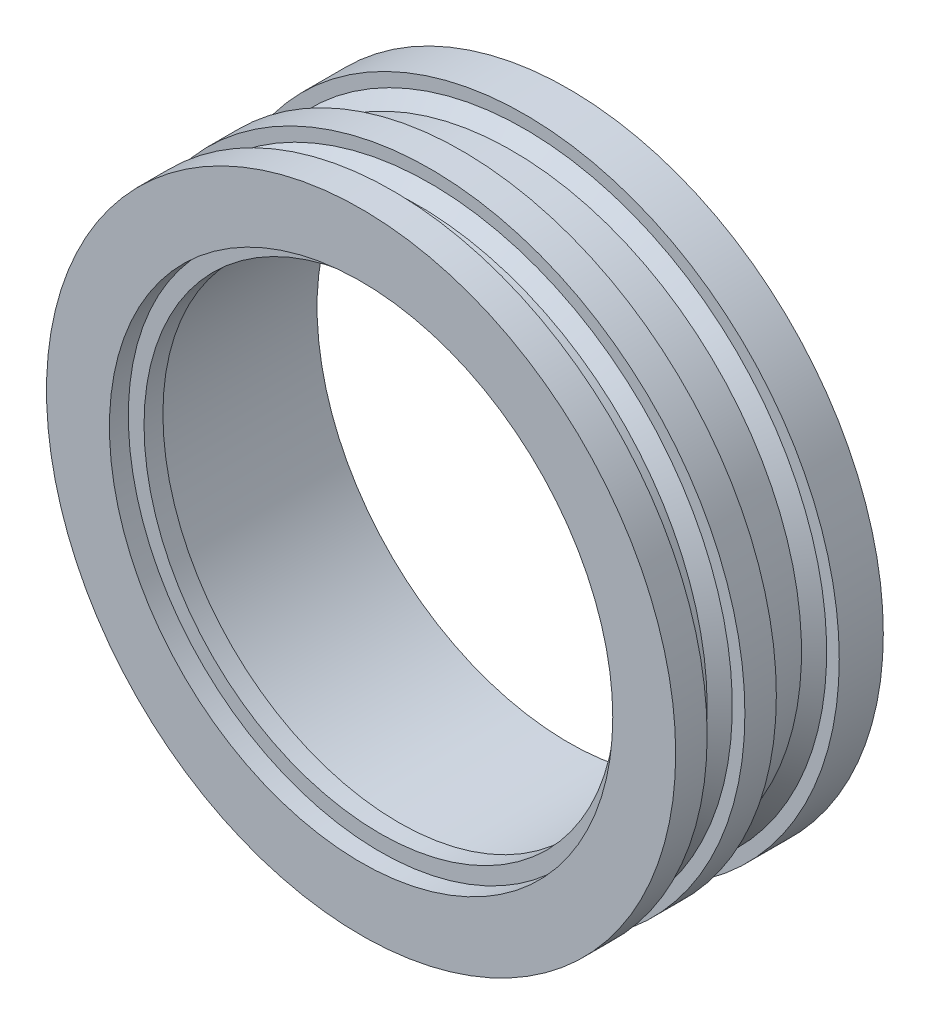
ISO-10303-21;
HEADER;
FILE_DESCRIPTION(('STEP AP214'),'2;1');
FILE_NAME('part.step','',(''),(''),'','','');
FILE_SCHEMA(('AUTOMOTIVE_DESIGN { 1 0 10303 214 1 1 1 1 }'));
ENDSEC;
DATA;
#1=APPLICATION_CONTEXT('core data for automotive mechanical design processes');
#2=APPLICATION_PROTOCOL_DEFINITION('international standard','automotive_design',2000,#1);
#3=PRODUCT_CONTEXT('',#1,'mechanical');
#4=PRODUCT('Part','Part','',(#3));
#5=PRODUCT_RELATED_PRODUCT_CATEGORY('part','',(#4));
#6=PRODUCT_DEFINITION_FORMATION('','',#4);
#7=PRODUCT_DEFINITION_CONTEXT('part definition',#1,'design');
#8=PRODUCT_DEFINITION('design','',#6,#7);
#9=PRODUCT_DEFINITION_SHAPE('','',#8);
#10=(LENGTH_UNIT() NAMED_UNIT(*) SI_UNIT(.MILLI.,.METRE.));
#11=(NAMED_UNIT(*) PLANE_ANGLE_UNIT() SI_UNIT($,.RADIAN.));
#12=(NAMED_UNIT(*) SI_UNIT($,.STERADIAN.) SOLID_ANGLE_UNIT());
#13=UNCERTAINTY_MEASURE_WITH_UNIT(LENGTH_MEASURE(1.E-05),#10,'distance_accuracy_value','');
#14=(GEOMETRIC_REPRESENTATION_CONTEXT(3) GLOBAL_UNCERTAINTY_ASSIGNED_CONTEXT((#13)) GLOBAL_UNIT_ASSIGNED_CONTEXT((#10,
#11,#12)) REPRESENTATION_CONTEXT('',''));
#15=CARTESIAN_POINT('',(0.,0.,0.));
#16=DIRECTION('',(0.,0.,1.));
#17=DIRECTION('',(1.,0.,0.));
#18=AXIS2_PLACEMENT_3D('',#15,#16,#17);
#19=CARTESIAN_POINT('',(0.,0.,558.8));
#20=DIRECTION('',(0.,0.,-1.));
#21=DIRECTION('',(-1.,0.,0.));
#22=AXIS2_PLACEMENT_3D('',#19,#20,#21);
#23=CONICAL_SURFACE('',#22,1219.2,0.785398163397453);
#24=CARTESIAN_POINT('',(0.,0.,558.8));
#25=DIRECTION('',(0.,0.,-1.));
#26=DIRECTION('',(-1.,0.,0.));
#27=AXIS2_PLACEMENT_3D('',#24,#25,#26);
#28=CIRCLE('',#27,1219.2);
#29=CARTESIAN_POINT('',(-1219.2,0.,558.8));
#30=VERTEX_POINT('',#29);
#31=EDGE_CURVE('E18',#30,#30,#28,.F.);
#32=ORIENTED_EDGE('',*,*,#31,.T.);
#33=EDGE_LOOP('',(#32));
#34=FACE_BOUND('',#33,.T.);
#35=CARTESIAN_POINT('',(0.,0.,609.6));
#36=DIRECTION('',(0.,0.,1.));
#37=DIRECTION('',(1.,0.,0.));
#38=AXIS2_PLACEMENT_3D('',#35,#36,#37);
#39=CIRCLE('',#38,1168.4);
#40=CARTESIAN_POINT('',(1168.4,0.,609.6));
#41=VERTEX_POINT('',#40);
#42=EDGE_CURVE('E30',#41,#41,#39,.F.);
#43=ORIENTED_EDGE('',*,*,#42,.T.);
#44=EDGE_LOOP('',(#43));
#45=FACE_BOUND('',#44,.T.);
#46=ADVANCED_FACE('F15',(#34,#45),#23,.T.);
#47=CARTESIAN_POINT('',(1168.4,0.,558.8));
#48=DIRECTION('',(0.,0.,-1.));
#49=DIRECTION('',(-1.,0.,0.));
#50=AXIS2_PLACEMENT_3D('',#47,#48,#49);
#51=PLANE('',#50);
#52=ORIENTED_EDGE('',*,*,#31,.F.);
#53=EDGE_LOOP('',(#52));
#54=FACE_BOUND('',#53,.T.);
#55=CARTESIAN_POINT('',(0.,0.,558.8));
#56=DIRECTION('',(0.,0.,1.));
#57=DIRECTION('',(1.,0.,0.));
#58=AXIS2_PLACEMENT_3D('',#55,#56,#57);
#59=CIRCLE('',#58,1270.);
#60=CARTESIAN_POINT('',(1270.,0.,558.8));
#61=VERTEX_POINT('',#60);
#62=EDGE_CURVE('E70',#61,#61,#59,.F.);
#63=ORIENTED_EDGE('',*,*,#62,.F.);
#64=EDGE_LOOP('',(#63));
#65=FACE_BOUND('',#64,.T.);
#66=ADVANCED_FACE('F82',(#54,#65),#51,.F.);
#67=CARTESIAN_POINT('',(0.,0.,660.4));
#68=DIRECTION('',(0.,0.,-1.));
#69=DIRECTION('',(-1.,0.,0.));
#70=AXIS2_PLACEMENT_3D('',#67,#68,#69);
#71=CYLINDRICAL_SURFACE('',#70,1168.4);
#72=CARTESIAN_POINT('',(0.,0.,660.4));
#73=DIRECTION('',(0.,0.,1.));
#74=DIRECTION('',(-1.,0.,0.));
#75=AXIS2_PLACEMENT_3D('',#72,#73,#74);
#76=CIRCLE('',#75,1168.4);
#77=CARTESIAN_POINT('',(-1168.4,0.,660.4));
#78=VERTEX_POINT('',#77);
#79=EDGE_CURVE('E69',#78,#78,#76,.T.);
#80=ORIENTED_EDGE('',*,*,#79,.F.);
#81=EDGE_LOOP('',(#80));
#82=FACE_BOUND('',#81,.T.);
#83=ORIENTED_EDGE('',*,*,#42,.F.);
#84=EDGE_LOOP('',(#83));
#85=FACE_BOUND('',#84,.T.);
#86=ADVANCED_FACE('F85',(#82,#85),#71,.T.);
#87=CARTESIAN_POINT('',(0.,0.,0.));
#88=DIRECTION('',(0.,0.,1.));
#89=DIRECTION('',(1.,0.,0.));
#90=AXIS2_PLACEMENT_3D('',#87,#88,#89);
#91=CYLINDRICAL_SURFACE('',#90,1270.);
#92=CARTESIAN_POINT('',(0.,0.,431.8));
#93=DIRECTION('',(0.,0.,1.));
#94=DIRECTION('',(1.,0.,0.));
#95=AXIS2_PLACEMENT_3D('',#92,#93,#94);
#96=CIRCLE('',#95,1270.);
#97=CARTESIAN_POINT('',(1270.,0.,431.8));
#98=VERTEX_POINT('',#97);
#99=EDGE_CURVE('E67',#98,#98,#96,.T.);
#100=ORIENTED_EDGE('',*,*,#99,.T.);
#101=EDGE_LOOP('',(#100));
#102=FACE_BOUND('',#101,.T.);
#103=ORIENTED_EDGE('',*,*,#62,.T.);
#104=EDGE_LOOP('',(#103));
#105=FACE_BOUND('',#104,.T.);
#106=ADVANCED_FACE('F91',(#102,#105),#91,.T.);
#107=CARTESIAN_POINT('',(0.,0.,711.2));
#108=DIRECTION('',(0.,0.,1.));
#109=DIRECTION('',(1.,0.,0.));
#110=AXIS2_PLACEMENT_3D('',#107,#108,#109);
#111=CONICAL_SURFACE('',#110,1219.2,0.785398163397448);
#112=ORIENTED_EDGE('',*,*,#79,.T.);
#113=EDGE_LOOP('',(#112));
#114=FACE_BOUND('',#113,.T.);
#115=CARTESIAN_POINT('',(0.,0.,711.2));
#116=DIRECTION('',(0.,0.,1.));
#117=DIRECTION('',(1.,0.,0.));
#118=AXIS2_PLACEMENT_3D('',#115,#116,#117);
#119=CIRCLE('',#118,1219.2);
#120=CARTESIAN_POINT('',(1219.2,0.,711.2));
#121=VERTEX_POINT('',#120);
#122=EDGE_CURVE('E64',#121,#121,#119,.F.);
#123=ORIENTED_EDGE('',*,*,#122,.T.);
#124=EDGE_LOOP('',(#123));
#125=FACE_BOUND('',#124,.T.);
#126=ADVANCED_FACE('F156',(#114,#125),#111,.T.);
#127=CARTESIAN_POINT('',(1270.,0.,431.8));
#128=DIRECTION('',(0.,0.,1.));
#129=DIRECTION('',(1.,0.,0.));
#130=AXIS2_PLACEMENT_3D('',#127,#128,#129);
#131=PLANE('',#130);
#132=CARTESIAN_POINT('',(0.,0.,431.8));
#133=DIRECTION('',(0.,0.,1.));
#134=DIRECTION('',(0.,-1.,0.));
#135=AXIS2_PLACEMENT_3D('',#132,#133,#134);
#136=CIRCLE('',#135,1219.2);
#137=CARTESIAN_POINT('',(0.,-1219.2,431.8));
#138=VERTEX_POINT('',#137);
#139=EDGE_CURVE('E61',#138,#138,#136,.F.);
#140=ORIENTED_EDGE('',*,*,#139,.F.);
#141=EDGE_LOOP('',(#140));
#142=FACE_BOUND('',#141,.T.);
#143=ORIENTED_EDGE('',*,*,#99,.F.);
#144=EDGE_LOOP('',(#143));
#145=FACE_BOUND('',#144,.T.);
#146=ADVANCED_FACE('F152',(#142,#145),#131,.F.);
#147=CARTESIAN_POINT('',(1270.,0.,711.2));
#148=DIRECTION('',(0.,0.,1.));
#149=DIRECTION('',(1.,0.,0.));
#150=AXIS2_PLACEMENT_3D('',#147,#148,#149);
#151=PLANE('',#150);
#152=ORIENTED_EDGE('',*,*,#122,.F.);
#153=EDGE_LOOP('',(#152));
#154=FACE_BOUND('',#153,.T.);
#155=CARTESIAN_POINT('',(0.,0.,711.2));
#156=DIRECTION('',(0.,0.,1.));
#157=DIRECTION('',(1.,0.,0.));
#158=AXIS2_PLACEMENT_3D('',#155,#156,#157);
#159=CIRCLE('',#158,1270.);
#160=CARTESIAN_POINT('',(1270.,0.,711.2));
#161=VERTEX_POINT('',#160);
#162=EDGE_CURVE('E58',#161,#161,#159,.T.);
#163=ORIENTED_EDGE('',*,*,#162,.F.);
#164=EDGE_LOOP('',(#163));
#165=FACE_BOUND('',#164,.T.);
#166=ADVANCED_FACE('F148',(#154,#165),#151,.F.);
#167=CARTESIAN_POINT('',(0.,0.,431.8));
#168=DIRECTION('',(0.,0.,1.));
#169=DIRECTION('',(0.,-1.,0.));
#170=AXIS2_PLACEMENT_3D('',#167,#168,#169);
#171=CONICAL_SURFACE('',#170,1219.2,0.785398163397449);
#172=ORIENTED_EDGE('',*,*,#139,.T.);
#173=EDGE_LOOP('',(#172));
#174=FACE_BOUND('',#173,.T.);
#175=CARTESIAN_POINT('',(0.,0.,381.));
#176=DIRECTION('',(0.,0.,1.));
#177=DIRECTION('',(1.,0.,0.));
#178=AXIS2_PLACEMENT_3D('',#175,#176,#177);
#179=CIRCLE('',#178,1168.4);
#180=CARTESIAN_POINT('',(1168.4,0.,381.));
#181=VERTEX_POINT('',#180);
#182=EDGE_CURVE('E57',#181,#181,#179,.T.);
#183=ORIENTED_EDGE('',*,*,#182,.T.);
#184=EDGE_LOOP('',(#183));
#185=FACE_BOUND('',#184,.T.);
#186=ADVANCED_FACE('F144',(#174,#185),#171,.T.);
#187=CARTESIAN_POINT('',(0.,0.,0.));
#188=DIRECTION('',(0.,0.,1.));
#189=DIRECTION('',(1.,0.,0.));
#190=AXIS2_PLACEMENT_3D('',#187,#188,#189);
#191=CYLINDRICAL_SURFACE('',#190,1270.);
#192=CARTESIAN_POINT('',(0.,0.,838.2));
#193=DIRECTION('',(0.,0.,1.));
#194=DIRECTION('',(1.,0.,0.));
#195=AXIS2_PLACEMENT_3D('',#192,#193,#194);
#196=CIRCLE('',#195,1270.);
#197=CARTESIAN_POINT('',(1270.,0.,838.2));
#198=VERTEX_POINT('',#197);
#199=EDGE_CURVE('E54',#198,#198,#196,.T.);
#200=ORIENTED_EDGE('',*,*,#199,.F.);
#201=EDGE_LOOP('',(#200));
#202=FACE_BOUND('',#201,.T.);
#203=ORIENTED_EDGE('',*,*,#162,.T.);
#204=EDGE_LOOP('',(#203));
#205=FACE_BOUND('',#204,.T.);
#206=ADVANCED_FACE('F140',(#202,#205),#191,.T.);
#207=CARTESIAN_POINT('',(0.,0.,381.));
#208=DIRECTION('',(0.,0.,-1.));
#209=DIRECTION('',(-1.,0.,0.));
#210=AXIS2_PLACEMENT_3D('',#207,#208,#209);
#211=CYLINDRICAL_SURFACE('',#210,1168.4);
#212=CARTESIAN_POINT('',(0.,0.,228.6));
#213=DIRECTION('',(0.,0.,-1.));
#214=DIRECTION('',(-1.,0.,0.));
#215=AXIS2_PLACEMENT_3D('',#212,#213,#214);
#216=CIRCLE('',#215,1168.4);
#217=CARTESIAN_POINT('',(-1168.4,0.,228.6));
#218=VERTEX_POINT('',#217);
#219=EDGE_CURVE('E53',#218,#218,#216,.T.);
#220=ORIENTED_EDGE('',*,*,#219,.F.);
#221=EDGE_LOOP('',(#220));
#222=FACE_BOUND('',#221,.T.);
#223=ORIENTED_EDGE('',*,*,#182,.F.);
#224=EDGE_LOOP('',(#223));
#225=FACE_BOUND('',#224,.T.);
#226=ADVANCED_FACE('F136',(#222,#225),#211,.T.);
#227=CARTESIAN_POINT('',(0.,0.,838.2));
#228=DIRECTION('',(0.,0.,1.));
#229=DIRECTION('',(1.,0.,0.));
#230=AXIS2_PLACEMENT_3D('',#227,#228,#229);
#231=PLANE('',#230);
#232=CARTESIAN_POINT('',(0.,0.,838.2));
#233=DIRECTION('',(0.,0.,1.));
#234=DIRECTION('',(1.,0.,0.));
#235=AXIS2_PLACEMENT_3D('',#232,#233,#234);
#236=CIRCLE('',#235,1016.);
#237=CARTESIAN_POINT('',(1016.,0.,838.2));
#238=VERTEX_POINT('',#237);
#239=EDGE_CURVE('E50',#238,#238,#236,.T.);
#240=ORIENTED_EDGE('',*,*,#239,.F.);
#241=EDGE_LOOP('',(#240));
#242=FACE_BOUND('',#241,.T.);
#243=ORIENTED_EDGE('',*,*,#199,.T.);
#244=EDGE_LOOP('',(#243));
#245=FACE_BOUND('',#244,.T.);
#246=ADVANCED_FACE('F132',(#242,#245),#231,.T.);
#247=CARTESIAN_POINT('',(0.,0.,177.8));
#248=DIRECTION('',(0.,0.,-1.));
#249=DIRECTION('',(-1.,0.,0.));
#250=AXIS2_PLACEMENT_3D('',#247,#248,#249);
#251=CONICAL_SURFACE('',#250,1219.2,0.785398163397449);
#252=ORIENTED_EDGE('',*,*,#219,.T.);
#253=EDGE_LOOP('',(#252));
#254=FACE_BOUND('',#253,.T.);
#255=CARTESIAN_POINT('',(0.,0.,177.8));
#256=DIRECTION('',(0.,0.,-1.));
#257=DIRECTION('',(-1.,0.,0.));
#258=AXIS2_PLACEMENT_3D('',#255,#256,#257);
#259=CIRCLE('',#258,1219.2);
#260=CARTESIAN_POINT('',(-1219.2,0.,177.8));
#261=VERTEX_POINT('',#260);
#262=EDGE_CURVE('E47',#261,#261,#259,.F.);
#263=ORIENTED_EDGE('',*,*,#262,.T.);
#264=EDGE_LOOP('',(#263));
#265=FACE_BOUND('',#264,.T.);
#266=ADVANCED_FACE('F128',(#254,#265),#251,.T.);
#267=CARTESIAN_POINT('',(0.,0.,762.));
#268=DIRECTION('',(0.,0.,1.));
#269=DIRECTION('',(1.,0.,0.));
#270=AXIS2_PLACEMENT_3D('',#267,#268,#269);
#271=CYLINDRICAL_SURFACE('',#270,1016.);
#272=ORIENTED_EDGE('',*,*,#239,.T.);
#273=EDGE_LOOP('',(#272));
#274=FACE_BOUND('',#273,.T.);
#275=CARTESIAN_POINT('',(0.,0.,762.));
#276=DIRECTION('',(0.,0.,1.));
#277=DIRECTION('',(1.,0.,0.));
#278=AXIS2_PLACEMENT_3D('',#275,#276,#277);
#279=CIRCLE('',#278,1016.);
#280=CARTESIAN_POINT('',(1016.,0.,762.));
#281=VERTEX_POINT('',#280);
#282=EDGE_CURVE('E44',#281,#281,#279,.T.);
#283=ORIENTED_EDGE('',*,*,#282,.F.);
#284=EDGE_LOOP('',(#283));
#285=FACE_BOUND('',#284,.T.);
#286=ADVANCED_FACE('F124',(#274,#285),#271,.F.);
#287=CARTESIAN_POINT('',(1168.4,0.,177.8));
#288=DIRECTION('',(0.,0.,-1.));
#289=DIRECTION('',(-1.,0.,0.));
#290=AXIS2_PLACEMENT_3D('',#287,#288,#289);
#291=PLANE('',#290);
#292=ORIENTED_EDGE('',*,*,#262,.F.);
#293=EDGE_LOOP('',(#292));
#294=FACE_BOUND('',#293,.T.);
#295=CARTESIAN_POINT('',(0.,0.,177.8));
#296=DIRECTION('',(0.,0.,1.));
#297=DIRECTION('',(1.,0.,0.));
#298=AXIS2_PLACEMENT_3D('',#295,#296,#297);
#299=CIRCLE('',#298,1270.);
#300=CARTESIAN_POINT('',(1270.,0.,177.8));
#301=VERTEX_POINT('',#300);
#302=EDGE_CURVE('E41',#301,#301,#299,.F.);
#303=ORIENTED_EDGE('',*,*,#302,.F.);
#304=EDGE_LOOP('',(#303));
#305=FACE_BOUND('',#304,.T.);
#306=ADVANCED_FACE('F120',(#294,#305),#291,.F.);
#307=CARTESIAN_POINT('',(0.,0.,762.));
#308=DIRECTION('',(0.,0.,1.));
#309=DIRECTION('',(1.,0.,0.));
#310=AXIS2_PLACEMENT_3D('',#307,#308,#309);
#311=PLANE('',#310);
#312=CARTESIAN_POINT('',(0.,0.,762.));
#313=DIRECTION('',(0.,0.,-1.));
#314=DIRECTION('',(-1.,0.,0.));
#315=AXIS2_PLACEMENT_3D('',#312,#313,#314);
#316=CIRCLE('',#315,952.5);
#317=CARTESIAN_POINT('',(-952.5,0.,762.));
#318=VERTEX_POINT('',#317);
#319=EDGE_CURVE('E38',#318,#318,#316,.F.);
#320=ORIENTED_EDGE('',*,*,#319,.F.);
#321=EDGE_LOOP('',(#320));
#322=FACE_BOUND('',#321,.T.);
#323=ORIENTED_EDGE('',*,*,#282,.T.);
#324=EDGE_LOOP('',(#323));
#325=FACE_BOUND('',#324,.T.);
#326=ADVANCED_FACE('F116',(#322,#325),#311,.T.);
#327=CARTESIAN_POINT('',(0.,0.,0.));
#328=DIRECTION('',(0.,0.,1.));
#329=DIRECTION('',(1.,0.,0.));
#330=AXIS2_PLACEMENT_3D('',#327,#328,#329);
#331=CYLINDRICAL_SURFACE('',#330,1270.);
#332=CARTESIAN_POINT('',(0.,0.,0.));
#333=DIRECTION('',(0.,0.,1.));
#334=DIRECTION('',(1.,0.,0.));
#335=AXIS2_PLACEMENT_3D('',#332,#333,#334);
#336=CIRCLE('',#335,1270.);
#337=CARTESIAN_POINT('',(1270.,0.,0.));
#338=VERTEX_POINT('',#337);
#339=EDGE_CURVE('E35',#338,#338,#336,.T.);
#340=ORIENTED_EDGE('',*,*,#339,.T.);
#341=EDGE_LOOP('',(#340));
#342=FACE_BOUND('',#341,.T.);
#343=ORIENTED_EDGE('',*,*,#302,.T.);
#344=EDGE_LOOP('',(#343));
#345=FACE_BOUND('',#344,.T.);
#346=ADVANCED_FACE('F112',(#342,#345),#331,.T.);
#347=CARTESIAN_POINT('',(0.,0.,762.));
#348=DIRECTION('',(0.,0.,-1.));
#349=DIRECTION('',(-1.,0.,0.));
#350=AXIS2_PLACEMENT_3D('',#347,#348,#349);
#351=CYLINDRICAL_SURFACE('',#350,952.5);
#352=CARTESIAN_POINT('',(0.,0.,685.8));
#353=DIRECTION('',(0.,0.,-1.));
#354=DIRECTION('',(-1.,0.,0.));
#355=AXIS2_PLACEMENT_3D('',#352,#353,#354);
#356=CIRCLE('',#355,952.5);
#357=CARTESIAN_POINT('',(-952.5,0.,685.8));
#358=VERTEX_POINT('',#357);
#359=EDGE_CURVE('E27',#358,#358,#356,.T.);
#360=ORIENTED_EDGE('',*,*,#359,.T.);
#361=EDGE_LOOP('',(#360));
#362=FACE_BOUND('',#361,.T.);
#363=ORIENTED_EDGE('',*,*,#319,.T.);
#364=EDGE_LOOP('',(#363));
#365=FACE_BOUND('',#364,.T.);
#366=ADVANCED_FACE('F108',(#362,#365),#351,.F.);
#367=CARTESIAN_POINT('',(0.,0.,0.));
#368=DIRECTION('',(0.,0.,1.));
#369=DIRECTION('',(1.,0.,0.));
#370=AXIS2_PLACEMENT_3D('',#367,#368,#369);
#371=PLANE('',#370);
#372=CARTESIAN_POINT('',(0.,0.,0.));
#373=DIRECTION('',(0.,0.,1.));
#374=DIRECTION('',(1.,0.,0.));
#375=AXIS2_PLACEMENT_3D('',#372,#373,#374);
#376=CIRCLE('',#375,1016.);
#377=CARTESIAN_POINT('',(1016.,0.,0.));
#378=VERTEX_POINT('',#377);
#379=EDGE_CURVE('E22',#378,#378,#376,.F.);
#380=ORIENTED_EDGE('',*,*,#379,.F.);
#381=EDGE_LOOP('',(#380));
#382=FACE_BOUND('',#381,.T.);
#383=ORIENTED_EDGE('',*,*,#339,.F.);
#384=EDGE_LOOP('',(#383));
#385=FACE_BOUND('',#384,.T.);
#386=ADVANCED_FACE('F102',(#382,#385),#371,.F.);
#387=CARTESIAN_POINT('',(0.,0.,685.8));
#388=DIRECTION('',(0.,0.,1.));
#389=DIRECTION('',(1.,0.,0.));
#390=AXIS2_PLACEMENT_3D('',#387,#388,#389);
#391=PLANE('',#390);
#392=ORIENTED_EDGE('',*,*,#359,.F.);
#393=EDGE_LOOP('',(#392));
#394=FACE_BOUND('',#393,.T.);
#395=CARTESIAN_POINT('',(0.,0.,685.8));
#396=DIRECTION('',(0.,0.,1.));
#397=DIRECTION('',(1.,0.,0.));
#398=AXIS2_PLACEMENT_3D('',#395,#396,#397);
#399=CIRCLE('',#398,1016.);
#400=CARTESIAN_POINT('',(1016.,0.,685.8));
#401=VERTEX_POINT('',#400);
#402=EDGE_CURVE('E10',#401,#401,#399,.T.);
#403=ORIENTED_EDGE('',*,*,#402,.F.);
#404=EDGE_LOOP('',(#403));
#405=FACE_BOUND('',#404,.T.);
#406=ADVANCED_FACE('F96',(#394,#405),#391,.F.);
#407=CARTESIAN_POINT('',(0.,0.,0.));
#408=DIRECTION('',(0.,0.,1.));
#409=DIRECTION('',(1.,0.,0.));
#410=AXIS2_PLACEMENT_3D('',#407,#408,#409);
#411=CYLINDRICAL_SURFACE('',#410,1016.);
#412=ORIENTED_EDGE('',*,*,#379,.T.);
#413=EDGE_LOOP('',(#412));
#414=FACE_BOUND('',#413,.T.);
#415=ORIENTED_EDGE('',*,*,#402,.T.);
#416=EDGE_LOOP('',(#415));
#417=FACE_BOUND('',#416,.T.);
#418=ADVANCED_FACE('F94',(#414,#417),#411,.F.);
#419=CLOSED_SHELL('',(#46,#66,#86,#106,#126,#146,#166,#186,#206,#226,#246,#266,#286,#306,#326,
#346,#366,#386,#406,#418));
#420=MANIFOLD_SOLID_BREP('B1',#419);
#421=ADVANCED_BREP_SHAPE_REPRESENTATION('',(#18,#420),#14);
#422=SHAPE_DEFINITION_REPRESENTATION(#9,#421);
ENDSEC;
END-ISO-10303-21;
